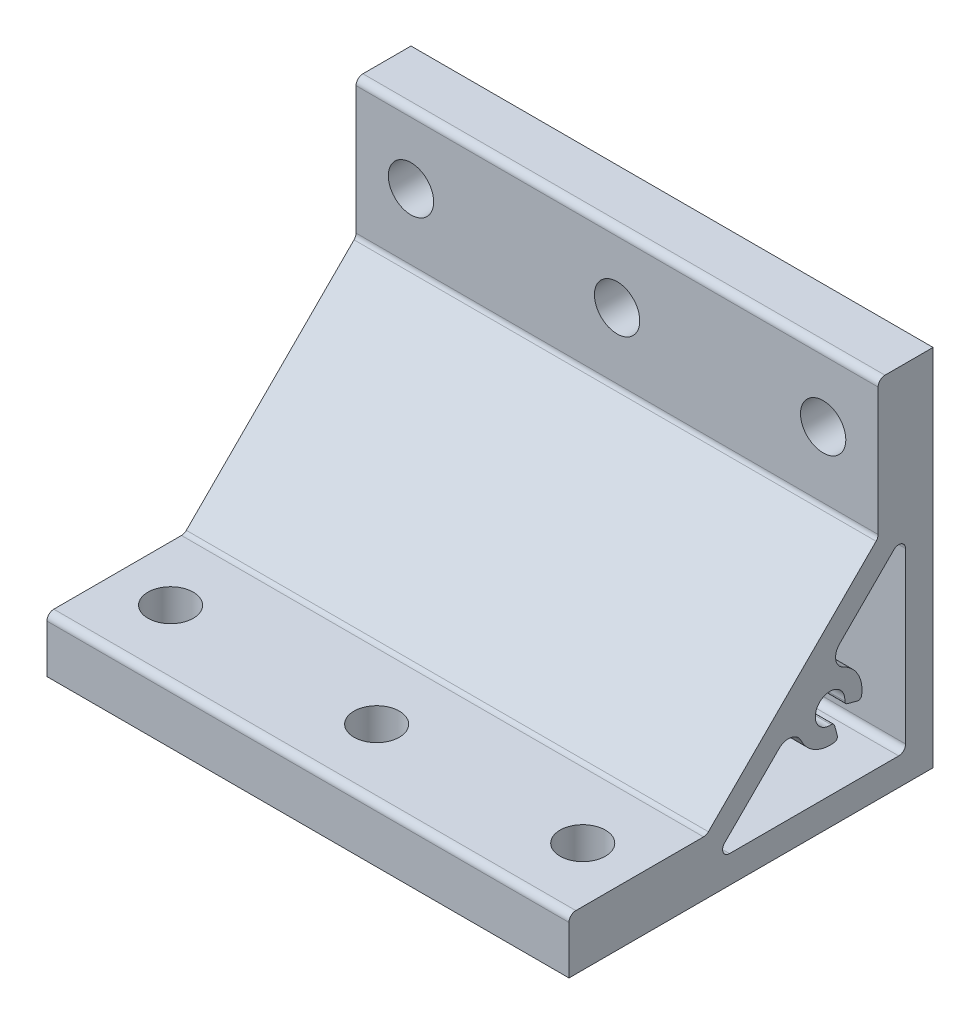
ISO-10303-21;
HEADER;
FILE_DESCRIPTION(('STEP AP214'),'2;1');
FILE_NAME('part.step','',(''),(''),'','','');
FILE_SCHEMA(('AUTOMOTIVE_DESIGN { 1 0 10303 214 1 1 1 1 }'));
ENDSEC;
DATA;
#1=APPLICATION_CONTEXT('core data for automotive mechanical design processes');
#2=APPLICATION_PROTOCOL_DEFINITION('international standard','automotive_design',2000,#1);
#3=PRODUCT_CONTEXT('',#1,'mechanical');
#4=PRODUCT('Part','Part','',(#3));
#5=PRODUCT_RELATED_PRODUCT_CATEGORY('part','',(#4));
#6=PRODUCT_DEFINITION_FORMATION('','',#4);
#7=PRODUCT_DEFINITION_CONTEXT('part definition',#1,'design');
#8=PRODUCT_DEFINITION('design','',#6,#7);
#9=PRODUCT_DEFINITION_SHAPE('','',#8);
#10=(LENGTH_UNIT() NAMED_UNIT(*) SI_UNIT(.MILLI.,.METRE.));
#11=(NAMED_UNIT(*) PLANE_ANGLE_UNIT() SI_UNIT($,.RADIAN.));
#12=(NAMED_UNIT(*) SI_UNIT($,.STERADIAN.) SOLID_ANGLE_UNIT());
#13=UNCERTAINTY_MEASURE_WITH_UNIT(LENGTH_MEASURE(1.E-05),#10,'distance_accuracy_value','');
#14=(GEOMETRIC_REPRESENTATION_CONTEXT(3) GLOBAL_UNCERTAINTY_ASSIGNED_CONTEXT((#13)) GLOBAL_UNIT_ASSIGNED_CONTEXT((#10,
#11,#12)) REPRESENTATION_CONTEXT('',''));
#15=CARTESIAN_POINT('',(0.,0.,0.));
#16=DIRECTION('',(0.,0.,1.));
#17=DIRECTION('',(1.,0.,0.));
#18=AXIS2_PLACEMENT_3D('',#15,#16,#17);
#19=CARTESIAN_POINT('',(38.,51.9999999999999,7.00000000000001));
#20=DIRECTION('',(1.,0.,0.));
#21=DIRECTION('',(0.,0.,-1.));
#22=AXIS2_PLACEMENT_3D('',#19,#20,#21);
#23=PLANE('',#22);
#24=DIRECTION('',(0.,0.,-1.));
#25=VECTOR('',#24,1.);
#26=CARTESIAN_POINT('',(38.,0.,53.));
#27=LINE('',#26,#25);
#28=CARTESIAN_POINT('',(38.,0.,53.));
#29=VERTEX_POINT('',#28);
#30=CARTESIAN_POINT('',(38.,0.,0.));
#31=VERTEX_POINT('',#30);
#32=EDGE_CURVE('E362',#29,#31,#27,.T.);
#33=ORIENTED_EDGE('',*,*,#32,.T.);
#34=DIRECTION('',(0.,1.,0.));
#35=VECTOR('',#34,1.);
#36=CARTESIAN_POINT('',(38.,0.,0.));
#37=LINE('',#36,#35);
#38=CARTESIAN_POINT('',(38.,53.,0.));
#39=VERTEX_POINT('',#38);
#40=EDGE_CURVE('E365',#31,#39,#37,.T.);
#41=ORIENTED_EDGE('',*,*,#40,.T.);
#42=DIRECTION('',(0.,0.,1.));
#43=VECTOR('',#42,1.);
#44=CARTESIAN_POINT('',(38.,52.9999999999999,7.00000000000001));
#45=LINE('',#44,#43);
#46=CARTESIAN_POINT('',(38.,52.9999999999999,7.00000000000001));
#47=VERTEX_POINT('',#46);
#48=EDGE_CURVE('E368',#39,#47,#45,.T.);
#49=ORIENTED_EDGE('',*,*,#48,.T.);
#50=CARTESIAN_POINT('',(38.,51.9999999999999,7.00000000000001));
#51=DIRECTION('',(1.,0.,0.));
#52=DIRECTION('',(0.,0.,-1.));
#53=AXIS2_PLACEMENT_3D('',#50,#51,#52);
#54=CIRCLE('',#53,1.);
#55=CARTESIAN_POINT('',(38.,51.9999999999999,8.00000000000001));
#56=VERTEX_POINT('',#55);
#57=EDGE_CURVE('E370',#47,#56,#54,.T.);
#58=ORIENTED_EDGE('',*,*,#57,.T.);
#59=DIRECTION('',(0.,-1.,0.));
#60=VECTOR('',#59,1.);
#61=CARTESIAN_POINT('',(38.,33.4142135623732,8.00000000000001));
#62=LINE('',#61,#60);
#63=CARTESIAN_POINT('',(38.,33.4142135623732,8.00000000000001));
#64=VERTEX_POINT('',#63);
#65=EDGE_CURVE('E372',#56,#64,#62,.T.);
#66=ORIENTED_EDGE('',*,*,#65,.T.);
#67=CARTESIAN_POINT('',(38.,33.4142135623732,9.00000000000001));
#68=DIRECTION('',(-1.,0.,0.));
#69=DIRECTION('',(0.,0.,-1.));
#70=AXIS2_PLACEMENT_3D('',#67,#68,#69);
#71=CIRCLE('',#70,1.00000000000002);
#72=CARTESIAN_POINT('',(38.,32.7071067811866,8.29289321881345));
#73=VERTEX_POINT('',#72);
#74=EDGE_CURVE('E374',#64,#73,#71,.T.);
#75=ORIENTED_EDGE('',*,*,#74,.T.);
#76=DIRECTION('',(0.,-0.707106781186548,0.707106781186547));
#77=VECTOR('',#76,1.);
#78=CARTESIAN_POINT('',(38.,32.7071067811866,8.29289321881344));
#79=LINE('',#78,#77);
#80=CARTESIAN_POINT('',(38.,8.29289321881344,32.7071067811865));
#81=VERTEX_POINT('',#80);
#82=EDGE_CURVE('E376',#73,#81,#79,.T.);
#83=ORIENTED_EDGE('',*,*,#82,.T.);
#84=CARTESIAN_POINT('',(38.,9.00000000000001,33.4142135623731));
#85=DIRECTION('',(-1.,0.,0.));
#86=DIRECTION('',(0.,0.,-1.));
#87=AXIS2_PLACEMENT_3D('',#84,#85,#86);
#88=CIRCLE('',#87,1.00000000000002);
#89=CARTESIAN_POINT('',(38.,7.99999999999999,33.4142135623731));
#90=VERTEX_POINT('',#89);
#91=EDGE_CURVE('E378',#81,#90,#88,.T.);
#92=ORIENTED_EDGE('',*,*,#91,.T.);
#93=DIRECTION('',(0.,0.,1.));
#94=VECTOR('',#93,1.);
#95=CARTESIAN_POINT('',(38.,8.00000000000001,52.));
#96=LINE('',#95,#94);
#97=CARTESIAN_POINT('',(38.,8.00000000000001,52.));
#98=VERTEX_POINT('',#97);
#99=EDGE_CURVE('E380',#90,#98,#96,.T.);
#100=ORIENTED_EDGE('',*,*,#99,.T.);
#101=CARTESIAN_POINT('',(38.,7.00000000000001,52.));
#102=DIRECTION('',(1.,0.,0.));
#103=DIRECTION('',(0.,0.,-1.));
#104=AXIS2_PLACEMENT_3D('',#101,#102,#103);
#105=CIRCLE('',#104,1.);
#106=CARTESIAN_POINT('',(38.,7.00000000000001,53.));
#107=VERTEX_POINT('',#106);
#108=EDGE_CURVE('E382',#98,#107,#105,.T.);
#109=ORIENTED_EDGE('',*,*,#108,.T.);
#110=DIRECTION('',(0.,-1.,0.));
#111=VECTOR('',#110,1.);
#112=CARTESIAN_POINT('',(38.,0.,53.));
#113=LINE('',#112,#111);
#114=EDGE_CURVE('E384',#107,#29,#113,.T.);
#115=ORIENTED_EDGE('',*,*,#114,.T.);
#116=EDGE_LOOP('',(#33,#41,#49,#58,#66,#75,#83,#92,#100,#109,#115));
#117=FACE_BOUND('',#116,.T.);
#118=DIRECTION('',(0.,-0.707106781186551,0.707106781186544));
#119=VECTOR('',#118,1.);
#120=CARTESIAN_POINT('',(38.,13.6074107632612,22.442841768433));
#121=LINE('',#120,#119);
#122=CARTESIAN_POINT('',(38.,13.6074107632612,22.442841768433));
#123=VERTEX_POINT('',#122);
#124=CARTESIAN_POINT('',(38.,5.70710678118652,30.3431457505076));
#125=VERTEX_POINT('',#124);
#126=EDGE_CURVE('E233',#123,#125,#121,.T.);
#127=ORIENTED_EDGE('',*,*,#126,.F.);
#128=CARTESIAN_POINT('',(38.,12.193197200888,21.0286282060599));
#129=DIRECTION('',(1.,0.,0.));
#130=DIRECTION('',(0.,0.,-1.));
#131=AXIS2_PLACEMENT_3D('',#128,#129,#130);
#132=CIRCLE('',#131,2.00000000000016);
#133=CARTESIAN_POINT('',(38.,13.0373484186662,19.2155069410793));
#134=VERTEX_POINT('',#133);
#135=EDGE_CURVE('E225',#134,#123,#132,.T.);
#136=ORIENTED_EDGE('',*,*,#135,.F.);
#137=CARTESIAN_POINT('',(38.,15.,15.));
#138=DIRECTION('',(-1.,0.,0.));
#139=DIRECTION('',(0.,0.,-1.));
#140=AXIS2_PLACEMENT_3D('',#137,#138,#139);
#141=CIRCLE('',#140,4.65);
#142=CARTESIAN_POINT('',(38.,10.3961625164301,14.3464095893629));
#143=VERTEX_POINT('',#142);
#144=EDGE_CURVE('E279',#143,#134,#141,.T.);
#145=ORIENTED_EDGE('',*,*,#144,.F.);
#146=CARTESIAN_POINT('',(38.,10.891198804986,14.4166881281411));
#147=DIRECTION('',(-1.,0.,0.));
#148=DIRECTION('',(0.,0.,-1.));
#149=AXIS2_PLACEMENT_3D('',#146,#147,#148);
#150=CIRCLE('',#149,0.499999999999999);
#151=CARTESIAN_POINT('',(38.,11.0206083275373,13.9337252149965));
#152=VERTEX_POINT('',#151);
#153=EDGE_CURVE('E277',#152,#143,#150,.T.);
#154=ORIENTED_EDGE('',*,*,#153,.F.);
#155=DIRECTION('',(0.,-0.965925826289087,-0.258819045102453));
#156=VECTOR('',#155,1.);
#157=CARTESIAN_POINT('',(38.,11.0206083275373,13.9337252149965));
#158=LINE('',#157,#156);
#159=CARTESIAN_POINT('',(38.,12.4862719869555,14.3264486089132));
#160=VERTEX_POINT('',#159);
#161=EDGE_CURVE('E275',#160,#152,#158,.T.);
#162=ORIENTED_EDGE('',*,*,#161,.F.);
#163=CARTESIAN_POINT('',(38.,12.3568624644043,14.8094115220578));
#164=DIRECTION('',(-1.,0.,0.));
#165=DIRECTION('',(0.,0.,-1.));
#166=AXIS2_PLACEMENT_3D('',#163,#164,#165);
#167=CIRCLE('',#166,0.49999999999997);
#168=CARTESIAN_POINT('',(38.,12.8555676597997,14.8453716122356));
#169=VERTEX_POINT('',#168);
#170=EDGE_CURVE('E273',#169,#160,#167,.T.);
#171=ORIENTED_EDGE('',*,*,#170,.F.);
#172=CARTESIAN_POINT('',(38.,15.,15.));
#173=DIRECTION('',(1.,0.,0.));
#174=DIRECTION('',(0.,0.,-1.));
#175=AXIS2_PLACEMENT_3D('',#172,#173,#174);
#176=CIRCLE('',#175,2.14999999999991);
#177=CARTESIAN_POINT('',(38.,14.8453716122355,12.8555676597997));
#178=VERTEX_POINT('',#177);
#179=EDGE_CURVE('E271',#178,#169,#176,.T.);
#180=ORIENTED_EDGE('',*,*,#179,.F.);
#181=CARTESIAN_POINT('',(38.,14.8094115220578,12.3568624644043));
#182=DIRECTION('',(-1.,0.,0.));
#183=DIRECTION('',(0.,0.,-1.));
#184=AXIS2_PLACEMENT_3D('',#181,#182,#183);
#185=CIRCLE('',#184,0.499999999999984);
#186=CARTESIAN_POINT('',(38.,14.3264486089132,12.4862719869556));
#187=VERTEX_POINT('',#186);
#188=EDGE_CURVE('E269',#187,#178,#185,.T.);
#189=ORIENTED_EDGE('',*,*,#188,.F.);
#190=DIRECTION('',(0.,0.2588190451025,0.965925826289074));
#191=VECTOR('',#190,1.);
#192=CARTESIAN_POINT('',(38.,13.9337252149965,11.0206083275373));
#193=LINE('',#192,#191);
#194=CARTESIAN_POINT('',(38.,13.9337252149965,11.0206083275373));
#195=VERTEX_POINT('',#194);
#196=EDGE_CURVE('E267',#195,#187,#193,.T.);
#197=ORIENTED_EDGE('',*,*,#196,.F.);
#198=CARTESIAN_POINT('',(38.,14.416688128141,10.8911988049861));
#199=DIRECTION('',(-1.,0.,0.));
#200=DIRECTION('',(0.,0.,-1.));
#201=AXIS2_PLACEMENT_3D('',#198,#199,#200);
#202=CIRCLE('',#201,0.499999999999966);
#203=CARTESIAN_POINT('',(38.,14.3464095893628,10.3961625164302));
#204=VERTEX_POINT('',#203);
#205=EDGE_CURVE('E265',#204,#195,#202,.T.);
#206=ORIENTED_EDGE('',*,*,#205,.F.);
#207=CARTESIAN_POINT('',(38.,15.,15.));
#208=DIRECTION('',(-1.,0.,0.));
#209=DIRECTION('',(0.,0.,-1.));
#210=AXIS2_PLACEMENT_3D('',#207,#208,#209);
#211=CIRCLE('',#210,4.64999999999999);
#212=CARTESIAN_POINT('',(38.,19.2155069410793,13.0373484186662));
#213=VERTEX_POINT('',#212);
#214=EDGE_CURVE('E263',#213,#204,#211,.T.);
#215=ORIENTED_EDGE('',*,*,#214,.F.);
#216=CARTESIAN_POINT('',(38.,21.0286282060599,12.1931972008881));
#217=DIRECTION('',(1.,0.,0.));
#218=DIRECTION('',(0.,0.,-1.));
#219=AXIS2_PLACEMENT_3D('',#216,#217,#218);
#220=CIRCLE('',#219,2.00000000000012);
#221=CARTESIAN_POINT('',(38.,22.4428417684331,13.6074107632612));
#222=VERTEX_POINT('',#221);
#223=EDGE_CURVE('E261',#222,#213,#220,.T.);
#224=ORIENTED_EDGE('',*,*,#223,.F.);
#225=DIRECTION('',(0.,-0.70710678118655,0.707106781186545));
#226=VECTOR('',#225,1.);
#227=CARTESIAN_POINT('',(38.,30.3431457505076,5.70710678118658));
#228=LINE('',#227,#226);
#229=CARTESIAN_POINT('',(38.,30.3431457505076,5.70710678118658));
#230=VERTEX_POINT('',#229);
#231=EDGE_CURVE('E259',#230,#222,#228,.T.);
#232=ORIENTED_EDGE('',*,*,#231,.F.);
#233=CARTESIAN_POINT('',(38.,29.6360389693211,5.));
#234=DIRECTION('',(1.,0.,0.));
#235=DIRECTION('',(0.,0.,-1.));
#236=AXIS2_PLACEMENT_3D('',#233,#234,#235);
#237=CIRCLE('',#236,0.999999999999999);
#238=CARTESIAN_POINT('',(38.,29.6360389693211,4.00000000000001));
#239=VERTEX_POINT('',#238);
#240=EDGE_CURVE('E257',#239,#230,#237,.T.);
#241=ORIENTED_EDGE('',*,*,#240,.F.);
#242=DIRECTION('',(0.,1.,0.));
#243=VECTOR('',#242,1.);
#244=CARTESIAN_POINT('',(38.,5.,4.));
#245=LINE('',#244,#243);
#246=CARTESIAN_POINT('',(38.,5.,4.));
#247=VERTEX_POINT('',#246);
#248=EDGE_CURVE('E255',#247,#239,#245,.T.);
#249=ORIENTED_EDGE('',*,*,#248,.F.);
#250=CARTESIAN_POINT('',(38.,5.,5.));
#251=DIRECTION('',(1.,0.,0.));
#252=DIRECTION('',(0.,0.,-1.));
#253=AXIS2_PLACEMENT_3D('',#250,#251,#252);
#254=CIRCLE('',#253,1.);
#255=CARTESIAN_POINT('',(38.,4.,5.));
#256=VERTEX_POINT('',#255);
#257=EDGE_CURVE('E253',#256,#247,#254,.T.);
#258=ORIENTED_EDGE('',*,*,#257,.F.);
#259=DIRECTION('',(0.,0.,-1.));
#260=VECTOR('',#259,1.);
#261=CARTESIAN_POINT('',(38.,4.,29.6360389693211));
#262=LINE('',#261,#260);
#263=CARTESIAN_POINT('',(38.,4.,29.6360389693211));
#264=VERTEX_POINT('',#263);
#265=EDGE_CURVE('E248',#264,#256,#262,.T.);
#266=ORIENTED_EDGE('',*,*,#265,.F.);
#267=CARTESIAN_POINT('',(38.,5.,29.6360389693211));
#268=DIRECTION('',(1.,0.,0.));
#269=DIRECTION('',(0.,0.,-1.));
#270=AXIS2_PLACEMENT_3D('',#267,#268,#269);
#271=CIRCLE('',#270,0.999999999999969);
#272=EDGE_CURVE('E246',#125,#264,#271,.T.);
#273=ORIENTED_EDGE('',*,*,#272,.F.);
#274=EDGE_LOOP('',(#127,#136,#145,#154,#162,#171,#180,#189,#197,#206,#215,#224,#232,#241,#249,
#258,#266,#273));
#275=FACE_BOUND('',#274,.T.);
#276=ADVANCED_FACE('F34',(#117,#275),#23,.T.);
#277=CARTESIAN_POINT('',(-38.,51.9999999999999,7.00000000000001));
#278=DIRECTION('',(1.,0.,0.));
#279=DIRECTION('',(0.,0.,-1.));
#280=AXIS2_PLACEMENT_3D('',#277,#278,#279);
#281=PLANE('',#280);
#282=DIRECTION('',(0.,0.,-1.));
#283=VECTOR('',#282,1.);
#284=CARTESIAN_POINT('',(-38.,0.,53.));
#285=LINE('',#284,#283);
#286=CARTESIAN_POINT('',(-38.,0.,53.));
#287=VERTEX_POINT('',#286);
#288=CARTESIAN_POINT('',(-38.,0.,0.));
#289=VERTEX_POINT('',#288);
#290=EDGE_CURVE('E241',#287,#289,#285,.T.);
#291=ORIENTED_EDGE('',*,*,#290,.F.);
#292=DIRECTION('',(0.,-1.,0.));
#293=VECTOR('',#292,1.);
#294=CARTESIAN_POINT('',(-38.,0.,53.));
#295=LINE('',#294,#293);
#296=CARTESIAN_POINT('',(-38.,7.00000000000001,53.));
#297=VERTEX_POINT('',#296);
#298=EDGE_CURVE('E366',#297,#287,#295,.T.);
#299=ORIENTED_EDGE('',*,*,#298,.F.);
#300=CARTESIAN_POINT('',(-38.,7.00000000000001,52.));
#301=DIRECTION('',(1.,0.,0.));
#302=DIRECTION('',(0.,0.,-1.));
#303=AXIS2_PLACEMENT_3D('',#300,#301,#302);
#304=CIRCLE('',#303,1.);
#305=CARTESIAN_POINT('',(-38.,8.00000000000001,52.));
#306=VERTEX_POINT('',#305);
#307=EDGE_CURVE('E405',#306,#297,#304,.T.);
#308=ORIENTED_EDGE('',*,*,#307,.F.);
#309=DIRECTION('',(0.,0.,1.));
#310=VECTOR('',#309,1.);
#311=CARTESIAN_POINT('',(-38.,8.00000000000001,52.));
#312=LINE('',#311,#310);
#313=CARTESIAN_POINT('',(-38.,7.99999999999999,33.4142135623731));
#314=VERTEX_POINT('',#313);
#315=EDGE_CURVE('E403',#314,#306,#312,.T.);
#316=ORIENTED_EDGE('',*,*,#315,.F.);
#317=CARTESIAN_POINT('',(-38.,9.00000000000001,33.4142135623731));
#318=DIRECTION('',(-1.,0.,0.));
#319=DIRECTION('',(0.,0.,-1.));
#320=AXIS2_PLACEMENT_3D('',#317,#318,#319);
#321=CIRCLE('',#320,1.00000000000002);
#322=CARTESIAN_POINT('',(-38.,8.29289321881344,32.7071067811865));
#323=VERTEX_POINT('',#322);
#324=EDGE_CURVE('E401',#323,#314,#321,.T.);
#325=ORIENTED_EDGE('',*,*,#324,.F.);
#326=DIRECTION('',(0.,-0.707106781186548,0.707106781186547));
#327=VECTOR('',#326,1.);
#328=CARTESIAN_POINT('',(-38.,32.7071067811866,8.29289321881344));
#329=LINE('',#328,#327);
#330=CARTESIAN_POINT('',(-38.,32.7071067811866,8.29289321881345));
#331=VERTEX_POINT('',#330);
#332=EDGE_CURVE('E399',#331,#323,#329,.T.);
#333=ORIENTED_EDGE('',*,*,#332,.F.);
#334=CARTESIAN_POINT('',(-38.,33.4142135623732,9.00000000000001));
#335=DIRECTION('',(-1.,0.,0.));
#336=DIRECTION('',(0.,0.,-1.));
#337=AXIS2_PLACEMENT_3D('',#334,#335,#336);
#338=CIRCLE('',#337,1.00000000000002);
#339=CARTESIAN_POINT('',(-38.,33.4142135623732,8.00000000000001));
#340=VERTEX_POINT('',#339);
#341=EDGE_CURVE('E397',#340,#331,#338,.T.);
#342=ORIENTED_EDGE('',*,*,#341,.F.);
#343=DIRECTION('',(0.,-1.,0.));
#344=VECTOR('',#343,1.);
#345=CARTESIAN_POINT('',(-38.,33.4142135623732,8.00000000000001));
#346=LINE('',#345,#344);
#347=CARTESIAN_POINT('',(-38.,51.9999999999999,8.00000000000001));
#348=VERTEX_POINT('',#347);
#349=EDGE_CURVE('E395',#348,#340,#346,.T.);
#350=ORIENTED_EDGE('',*,*,#349,.F.);
#351=CARTESIAN_POINT('',(-38.,51.9999999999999,7.00000000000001));
#352=DIRECTION('',(1.,0.,0.));
#353=DIRECTION('',(0.,0.,-1.));
#354=AXIS2_PLACEMENT_3D('',#351,#352,#353);
#355=CIRCLE('',#354,1.);
#356=CARTESIAN_POINT('',(-38.,52.9999999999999,7.00000000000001));
#357=VERTEX_POINT('',#356);
#358=EDGE_CURVE('E393',#357,#348,#355,.T.);
#359=ORIENTED_EDGE('',*,*,#358,.F.);
#360=DIRECTION('',(0.,0.,1.));
#361=VECTOR('',#360,1.);
#362=CARTESIAN_POINT('',(-38.,52.9999999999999,7.00000000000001));
#363=LINE('',#362,#361);
#364=CARTESIAN_POINT('',(-38.,53.,0.));
#365=VERTEX_POINT('',#364);
#366=EDGE_CURVE('E391',#365,#357,#363,.T.);
#367=ORIENTED_EDGE('',*,*,#366,.F.);
#368=DIRECTION('',(0.,1.,0.));
#369=VECTOR('',#368,1.);
#370=CARTESIAN_POINT('',(-38.,0.,0.));
#371=LINE('',#370,#369);
#372=EDGE_CURVE('E389',#289,#365,#371,.T.);
#373=ORIENTED_EDGE('',*,*,#372,.F.);
#374=EDGE_LOOP('',(#291,#299,#308,#316,#325,#333,#342,#350,#359,#367,#373));
#375=FACE_BOUND('',#374,.T.);
#376=CARTESIAN_POINT('',(-38.,12.193197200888,21.0286282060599));
#377=DIRECTION('',(1.,0.,0.));
#378=DIRECTION('',(0.,0.,-1.));
#379=AXIS2_PLACEMENT_3D('',#376,#377,#378);
#380=CIRCLE('',#379,2.00000000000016);
#381=CARTESIAN_POINT('',(-38.,13.0373484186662,19.2155069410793));
#382=VERTEX_POINT('',#381);
#383=CARTESIAN_POINT('',(-38.,13.6074107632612,22.442841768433));
#384=VERTEX_POINT('',#383);
#385=EDGE_CURVE('E57',#382,#384,#380,.T.);
#386=ORIENTED_EDGE('',*,*,#385,.T.);
#387=DIRECTION('',(0.,-0.707106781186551,0.707106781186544));
#388=VECTOR('',#387,1.);
#389=CARTESIAN_POINT('',(-38.,13.6074107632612,22.442841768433));
#390=LINE('',#389,#388);
#391=CARTESIAN_POINT('',(-38.,5.70710678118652,30.3431457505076));
#392=VERTEX_POINT('',#391);
#393=EDGE_CURVE('E240',#384,#392,#390,.T.);
#394=ORIENTED_EDGE('',*,*,#393,.T.);
#395=CARTESIAN_POINT('',(-38.,5.,29.6360389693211));
#396=DIRECTION('',(1.,0.,0.));
#397=DIRECTION('',(0.,0.,-1.));
#398=AXIS2_PLACEMENT_3D('',#395,#396,#397);
#399=CIRCLE('',#398,0.999999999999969);
#400=CARTESIAN_POINT('',(-38.,4.,29.6360389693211));
#401=VERTEX_POINT('',#400);
#402=EDGE_CURVE('E284',#392,#401,#399,.T.);
#403=ORIENTED_EDGE('',*,*,#402,.T.);
#404=DIRECTION('',(0.,0.,-1.));
#405=VECTOR('',#404,1.);
#406=CARTESIAN_POINT('',(-38.,4.,29.6360389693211));
#407=LINE('',#406,#405);
#408=CARTESIAN_POINT('',(-38.,4.,5.));
#409=VERTEX_POINT('',#408);
#410=EDGE_CURVE('E287',#401,#409,#407,.T.);
#411=ORIENTED_EDGE('',*,*,#410,.T.);
#412=CARTESIAN_POINT('',(-38.,5.,5.));
#413=DIRECTION('',(1.,0.,0.));
#414=DIRECTION('',(0.,0.,-1.));
#415=AXIS2_PLACEMENT_3D('',#412,#413,#414);
#416=CIRCLE('',#415,1.);
#417=CARTESIAN_POINT('',(-38.,5.,4.));
#418=VERTEX_POINT('',#417);
#419=EDGE_CURVE('E290',#409,#418,#416,.T.);
#420=ORIENTED_EDGE('',*,*,#419,.T.);
#421=DIRECTION('',(0.,1.,0.));
#422=VECTOR('',#421,1.);
#423=CARTESIAN_POINT('',(-38.,5.,4.));
#424=LINE('',#423,#422);
#425=CARTESIAN_POINT('',(-38.,29.6360389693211,4.00000000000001));
#426=VERTEX_POINT('',#425);
#427=EDGE_CURVE('E293',#418,#426,#424,.T.);
#428=ORIENTED_EDGE('',*,*,#427,.T.);
#429=CARTESIAN_POINT('',(-38.,29.6360389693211,5.));
#430=DIRECTION('',(1.,0.,0.));
#431=DIRECTION('',(0.,0.,-1.));
#432=AXIS2_PLACEMENT_3D('',#429,#430,#431);
#433=CIRCLE('',#432,0.999999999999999);
#434=CARTESIAN_POINT('',(-38.,30.3431457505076,5.70710678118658));
#435=VERTEX_POINT('',#434);
#436=EDGE_CURVE('E296',#426,#435,#433,.T.);
#437=ORIENTED_EDGE('',*,*,#436,.T.);
#438=DIRECTION('',(0.,-0.70710678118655,0.707106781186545));
#439=VECTOR('',#438,1.);
#440=CARTESIAN_POINT('',(-38.,30.3431457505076,5.70710678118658));
#441=LINE('',#440,#439);
#442=CARTESIAN_POINT('',(-38.,22.4428417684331,13.6074107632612));
#443=VERTEX_POINT('',#442);
#444=EDGE_CURVE('E299',#435,#443,#441,.T.);
#445=ORIENTED_EDGE('',*,*,#444,.T.);
#446=CARTESIAN_POINT('',(-38.,21.0286282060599,12.1931972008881));
#447=DIRECTION('',(1.,0.,0.));
#448=DIRECTION('',(0.,0.,-1.));
#449=AXIS2_PLACEMENT_3D('',#446,#447,#448);
#450=CIRCLE('',#449,2.00000000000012);
#451=CARTESIAN_POINT('',(-38.,19.2155069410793,13.0373484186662));
#452=VERTEX_POINT('',#451);
#453=EDGE_CURVE('E302',#443,#452,#450,.T.);
#454=ORIENTED_EDGE('',*,*,#453,.T.);
#455=CARTESIAN_POINT('',(-38.,15.,15.));
#456=DIRECTION('',(-1.,0.,0.));
#457=DIRECTION('',(0.,0.,-1.));
#458=AXIS2_PLACEMENT_3D('',#455,#456,#457);
#459=CIRCLE('',#458,4.64999999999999);
#460=CARTESIAN_POINT('',(-38.,14.3464095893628,10.3961625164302));
#461=VERTEX_POINT('',#460);
#462=EDGE_CURVE('E305',#452,#461,#459,.T.);
#463=ORIENTED_EDGE('',*,*,#462,.T.);
#464=CARTESIAN_POINT('',(-38.,14.416688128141,10.8911988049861));
#465=DIRECTION('',(-1.,0.,0.));
#466=DIRECTION('',(0.,0.,-1.));
#467=AXIS2_PLACEMENT_3D('',#464,#465,#466);
#468=CIRCLE('',#467,0.499999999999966);
#469=CARTESIAN_POINT('',(-38.,13.9337252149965,11.0206083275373));
#470=VERTEX_POINT('',#469);
#471=EDGE_CURVE('E308',#461,#470,#468,.T.);
#472=ORIENTED_EDGE('',*,*,#471,.T.);
#473=DIRECTION('',(0.,0.2588190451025,0.965925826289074));
#474=VECTOR('',#473,1.);
#475=CARTESIAN_POINT('',(-38.,13.9337252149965,11.0206083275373));
#476=LINE('',#475,#474);
#477=CARTESIAN_POINT('',(-38.,14.3264486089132,12.4862719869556));
#478=VERTEX_POINT('',#477);
#479=EDGE_CURVE('E311',#470,#478,#476,.T.);
#480=ORIENTED_EDGE('',*,*,#479,.T.);
#481=CARTESIAN_POINT('',(-38.,14.8094115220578,12.3568624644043));
#482=DIRECTION('',(-1.,0.,0.));
#483=DIRECTION('',(0.,0.,-1.));
#484=AXIS2_PLACEMENT_3D('',#481,#482,#483);
#485=CIRCLE('',#484,0.499999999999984);
#486=CARTESIAN_POINT('',(-38.,14.8453716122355,12.8555676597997));
#487=VERTEX_POINT('',#486);
#488=EDGE_CURVE('E314',#478,#487,#485,.T.);
#489=ORIENTED_EDGE('',*,*,#488,.T.);
#490=CARTESIAN_POINT('',(-38.,15.,15.));
#491=DIRECTION('',(1.,0.,0.));
#492=DIRECTION('',(0.,0.,-1.));
#493=AXIS2_PLACEMENT_3D('',#490,#491,#492);
#494=CIRCLE('',#493,2.14999999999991);
#495=CARTESIAN_POINT('',(-38.,12.8555676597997,14.8453716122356));
#496=VERTEX_POINT('',#495);
#497=EDGE_CURVE('E317',#487,#496,#494,.T.);
#498=ORIENTED_EDGE('',*,*,#497,.T.);
#499=CARTESIAN_POINT('',(-38.,12.3568624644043,14.8094115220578));
#500=DIRECTION('',(-1.,0.,0.));
#501=DIRECTION('',(0.,0.,-1.));
#502=AXIS2_PLACEMENT_3D('',#499,#500,#501);
#503=CIRCLE('',#502,0.49999999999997);
#504=CARTESIAN_POINT('',(-38.,12.4862719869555,14.3264486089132));
#505=VERTEX_POINT('',#504);
#506=EDGE_CURVE('E320',#496,#505,#503,.T.);
#507=ORIENTED_EDGE('',*,*,#506,.T.);
#508=DIRECTION('',(0.,-0.965925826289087,-0.258819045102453));
#509=VECTOR('',#508,1.);
#510=CARTESIAN_POINT('',(-38.,11.0206083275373,13.9337252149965));
#511=LINE('',#510,#509);
#512=CARTESIAN_POINT('',(-38.,11.0206083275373,13.9337252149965));
#513=VERTEX_POINT('',#512);
#514=EDGE_CURVE('E323',#505,#513,#511,.T.);
#515=ORIENTED_EDGE('',*,*,#514,.T.);
#516=CARTESIAN_POINT('',(-38.,10.891198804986,14.4166881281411));
#517=DIRECTION('',(-1.,0.,0.));
#518=DIRECTION('',(0.,0.,-1.));
#519=AXIS2_PLACEMENT_3D('',#516,#517,#518);
#520=CIRCLE('',#519,0.499999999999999);
#521=CARTESIAN_POINT('',(-38.,10.3961625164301,14.3464095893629));
#522=VERTEX_POINT('',#521);
#523=EDGE_CURVE('E326',#513,#522,#520,.T.);
#524=ORIENTED_EDGE('',*,*,#523,.T.);
#525=CARTESIAN_POINT('',(-38.,15.,15.));
#526=DIRECTION('',(-1.,0.,0.));
#527=DIRECTION('',(0.,0.,-1.));
#528=AXIS2_PLACEMENT_3D('',#525,#526,#527);
#529=CIRCLE('',#528,4.65);
#530=EDGE_CURVE('E234',#522,#382,#529,.T.);
#531=ORIENTED_EDGE('',*,*,#530,.T.);
#532=EDGE_LOOP('',(#386,#394,#403,#411,#420,#428,#437,#445,#454,#463,#472,#480,#489,#498,#507,
#515,#524,#531));
#533=FACE_BOUND('',#532,.T.);
#534=ADVANCED_FACE('F444',(#375,#533),#281,.F.);
#535=CARTESIAN_POINT('',(38.,0.,53.));
#536=DIRECTION('',(0.,1.,0.));
#537=DIRECTION('',(0.,0.,1.));
#538=AXIS2_PLACEMENT_3D('',#535,#536,#537);
#539=PLANE('',#538);
#540=CARTESIAN_POINT('',(-30.,0.,43.));
#541=DIRECTION('',(0.,1.,0.));
#542=DIRECTION('',(0.,0.,1.));
#543=AXIS2_PLACEMENT_3D('',#540,#541,#542);
#544=CIRCLE('',#543,3.3);
#545=CARTESIAN_POINT('',(-30.,0.,46.3));
#546=VERTEX_POINT('',#545);
#547=EDGE_CURVE('E834',#546,#546,#544,.T.);
#548=ORIENTED_EDGE('',*,*,#547,.T.);
#549=EDGE_LOOP('',(#548));
#550=FACE_BOUND('',#549,.T.);
#551=CARTESIAN_POINT('',(0.,0.,43.));
#552=DIRECTION('',(0.,1.,0.));
#553=DIRECTION('',(0.,0.,1.));
#554=AXIS2_PLACEMENT_3D('',#551,#552,#553);
#555=CIRCLE('',#554,3.3);
#556=CARTESIAN_POINT('',(0.,0.,46.3));
#557=VERTEX_POINT('',#556);
#558=EDGE_CURVE('E838',#557,#557,#555,.T.);
#559=ORIENTED_EDGE('',*,*,#558,.T.);
#560=EDGE_LOOP('',(#559));
#561=FACE_BOUND('',#560,.T.);
#562=CARTESIAN_POINT('',(30.,0.,43.));
#563=DIRECTION('',(0.,1.,0.));
#564=DIRECTION('',(0.,0.,1.));
#565=AXIS2_PLACEMENT_3D('',#562,#563,#564);
#566=CIRCLE('',#565,3.3);
#567=CARTESIAN_POINT('',(30.,0.,46.3));
#568=VERTEX_POINT('',#567);
#569=EDGE_CURVE('E841',#568,#568,#566,.T.);
#570=ORIENTED_EDGE('',*,*,#569,.T.);
#571=EDGE_LOOP('',(#570));
#572=FACE_BOUND('',#571,.T.);
#573=ORIENTED_EDGE('',*,*,#290,.T.);
#574=DIRECTION('',(-1.,0.,0.));
#575=VECTOR('',#574,1.);
#576=CARTESIAN_POINT('',(38.,0.,0.));
#577=LINE('',#576,#575);
#578=EDGE_CURVE('E11',#31,#289,#577,.T.);
#579=ORIENTED_EDGE('',*,*,#578,.F.);
#580=ORIENTED_EDGE('',*,*,#32,.F.);
#581=DIRECTION('',(-1.,0.,0.));
#582=VECTOR('',#581,1.);
#583=CARTESIAN_POINT('',(38.,0.,53.));
#584=LINE('',#583,#582);
#585=EDGE_CURVE('E386',#29,#287,#584,.T.);
#586=ORIENTED_EDGE('',*,*,#585,.T.);
#587=EDGE_LOOP('',(#573,#579,#580,#586));
#588=FACE_BOUND('',#587,.T.);
#589=ADVANCED_FACE('F36',(#550,#561,#572,#588),#539,.F.);
#590=CARTESIAN_POINT('',(38.,0.,0.));
#591=DIRECTION('',(0.,0.,1.));
#592=DIRECTION('',(1.,0.,0.));
#593=AXIS2_PLACEMENT_3D('',#590,#591,#592);
#594=PLANE('',#593);
#595=CARTESIAN_POINT('',(-30.,42.9999999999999,0.));
#596=DIRECTION('',(0.,0.,1.));
#597=DIRECTION('',(1.,0.,0.));
#598=AXIS2_PLACEMENT_3D('',#595,#596,#597);
#599=CIRCLE('',#598,3.3);
#600=CARTESIAN_POINT('',(-26.7,42.9999999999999,0.));
#601=VERTEX_POINT('',#600);
#602=EDGE_CURVE('E846',#601,#601,#599,.T.);
#603=ORIENTED_EDGE('',*,*,#602,.T.);
#604=EDGE_LOOP('',(#603));
#605=FACE_BOUND('',#604,.T.);
#606=CARTESIAN_POINT('',(0.,42.9999999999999,0.));
#607=DIRECTION('',(0.,0.,1.));
#608=DIRECTION('',(1.,0.,0.));
#609=AXIS2_PLACEMENT_3D('',#606,#607,#608);
#610=CIRCLE('',#609,3.3);
#611=CARTESIAN_POINT('',(3.3,42.9999999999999,0.));
#612=VERTEX_POINT('',#611);
#613=EDGE_CURVE('E857',#612,#612,#610,.T.);
#614=ORIENTED_EDGE('',*,*,#613,.T.);
#615=EDGE_LOOP('',(#614));
#616=FACE_BOUND('',#615,.T.);
#617=CARTESIAN_POINT('',(30.,42.9999999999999,0.));
#618=DIRECTION('',(0.,0.,1.));
#619=DIRECTION('',(1.,0.,0.));
#620=AXIS2_PLACEMENT_3D('',#617,#618,#619);
#621=CIRCLE('',#620,3.3);
#622=CARTESIAN_POINT('',(33.3,42.9999999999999,0.));
#623=VERTEX_POINT('',#622);
#624=EDGE_CURVE('E282',#623,#623,#621,.T.);
#625=ORIENTED_EDGE('',*,*,#624,.T.);
#626=EDGE_LOOP('',(#625));
#627=FACE_BOUND('',#626,.T.);
#628=ORIENTED_EDGE('',*,*,#372,.T.);
#629=DIRECTION('',(-1.,0.,0.));
#630=VECTOR('',#629,1.);
#631=CARTESIAN_POINT('',(38.,53.,0.));
#632=LINE('',#631,#630);
#633=EDGE_CURVE('E42',#39,#365,#632,.T.);
#634=ORIENTED_EDGE('',*,*,#633,.F.);
#635=ORIENTED_EDGE('',*,*,#40,.F.);
#636=ORIENTED_EDGE('',*,*,#578,.T.);
#637=EDGE_LOOP('',(#628,#634,#635,#636));
#638=FACE_BOUND('',#637,.T.);
#639=ADVANCED_FACE('F461',(#605,#616,#627,#638),#594,.F.);
#640=CARTESIAN_POINT('',(38.,52.9999999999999,7.00000000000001));
#641=DIRECTION('',(0.,-1.,0.));
#642=DIRECTION('',(0.,0.,-1.));
#643=AXIS2_PLACEMENT_3D('',#640,#641,#642);
#644=PLANE('',#643);
#645=ORIENTED_EDGE('',*,*,#366,.T.);
#646=DIRECTION('',(-1.,0.,0.));
#647=VECTOR('',#646,1.);
#648=CARTESIAN_POINT('',(38.,52.9999999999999,7.00000000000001));
#649=LINE('',#648,#647);
#650=EDGE_CURVE('E431',#47,#357,#649,.T.);
#651=ORIENTED_EDGE('',*,*,#650,.F.);
#652=ORIENTED_EDGE('',*,*,#48,.F.);
#653=ORIENTED_EDGE('',*,*,#633,.T.);
#654=EDGE_LOOP('',(#645,#651,#652,#653));
#655=FACE_BOUND('',#654,.T.);
#656=ADVANCED_FACE('F438',(#655),#644,.F.);
#657=CARTESIAN_POINT('',(38.,51.9999999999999,7.00000000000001));
#658=DIRECTION('',(-1.,0.,0.));
#659=DIRECTION('',(0.,0.,1.));
#660=AXIS2_PLACEMENT_3D('',#657,#658,#659);
#661=CYLINDRICAL_SURFACE('',#660,1.);
#662=ORIENTED_EDGE('',*,*,#358,.T.);
#663=DIRECTION('',(-1.,0.,0.));
#664=VECTOR('',#663,1.);
#665=CARTESIAN_POINT('',(38.,51.9999999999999,8.00000000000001));
#666=LINE('',#665,#664);
#667=EDGE_CURVE('E428',#56,#348,#666,.T.);
#668=ORIENTED_EDGE('',*,*,#667,.F.);
#669=ORIENTED_EDGE('',*,*,#57,.F.);
#670=ORIENTED_EDGE('',*,*,#650,.T.);
#671=EDGE_LOOP('',(#662,#668,#669,#670));
#672=FACE_BOUND('',#671,.T.);
#673=ADVANCED_FACE('F450',(#672),#661,.T.);
#674=CARTESIAN_POINT('',(38.,33.4142135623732,8.00000000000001));
#675=DIRECTION('',(0.,0.,-1.));
#676=DIRECTION('',(-1.,0.,0.));
#677=AXIS2_PLACEMENT_3D('',#674,#675,#676);
#678=PLANE('',#677);
#679=CARTESIAN_POINT('',(-30.,42.9999999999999,8.00000000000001));
#680=DIRECTION('',(0.,0.,1.));
#681=DIRECTION('',(1.,0.,0.));
#682=AXIS2_PLACEMENT_3D('',#679,#680,#681);
#683=CIRCLE('',#682,3.29999999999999);
#684=CARTESIAN_POINT('',(-26.7,42.9999999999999,8.00000000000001));
#685=VERTEX_POINT('',#684);
#686=EDGE_CURVE('E842',#685,#685,#683,.T.);
#687=ORIENTED_EDGE('',*,*,#686,.F.);
#688=EDGE_LOOP('',(#687));
#689=FACE_BOUND('',#688,.T.);
#690=CARTESIAN_POINT('',(0.,42.9999999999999,8.00000000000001));
#691=DIRECTION('',(0.,0.,1.));
#692=DIRECTION('',(1.,0.,0.));
#693=AXIS2_PLACEMENT_3D('',#690,#691,#692);
#694=CIRCLE('',#693,3.29999999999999);
#695=CARTESIAN_POINT('',(3.29999999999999,42.9999999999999,8.00000000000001));
#696=VERTEX_POINT('',#695);
#697=EDGE_CURVE('E854',#696,#696,#694,.T.);
#698=ORIENTED_EDGE('',*,*,#697,.F.);
#699=EDGE_LOOP('',(#698));
#700=FACE_BOUND('',#699,.T.);
#701=CARTESIAN_POINT('',(30.,42.9999999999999,8.00000000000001));
#702=DIRECTION('',(0.,0.,1.));
#703=DIRECTION('',(1.,0.,0.));
#704=AXIS2_PLACEMENT_3D('',#701,#702,#703);
#705=CIRCLE('',#704,3.29999999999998);
#706=CARTESIAN_POINT('',(33.3,42.9999999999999,8.00000000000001));
#707=VERTEX_POINT('',#706);
#708=EDGE_CURVE('E860',#707,#707,#705,.T.);
#709=ORIENTED_EDGE('',*,*,#708,.F.);
#710=EDGE_LOOP('',(#709));
#711=FACE_BOUND('',#710,.T.);
#712=ORIENTED_EDGE('',*,*,#349,.T.);
#713=DIRECTION('',(-1.,0.,0.));
#714=VECTOR('',#713,1.);
#715=CARTESIAN_POINT('',(38.,33.4142135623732,8.00000000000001));
#716=LINE('',#715,#714);
#717=EDGE_CURVE('E425',#64,#340,#716,.T.);
#718=ORIENTED_EDGE('',*,*,#717,.F.);
#719=ORIENTED_EDGE('',*,*,#65,.F.);
#720=ORIENTED_EDGE('',*,*,#667,.T.);
#721=EDGE_LOOP('',(#712,#718,#719,#720));
#722=FACE_BOUND('',#721,.T.);
#723=ADVANCED_FACE('F454',(#689,#700,#711,#722),#678,.F.);
#724=CARTESIAN_POINT('',(38.,33.4142135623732,9.00000000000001));
#725=DIRECTION('',(-1.,0.,0.));
#726=DIRECTION('',(0.,0.,1.));
#727=AXIS2_PLACEMENT_3D('',#724,#725,#726);
#728=CYLINDRICAL_SURFACE('',#727,1.00000000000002);
#729=ORIENTED_EDGE('',*,*,#341,.T.);
#730=DIRECTION('',(-1.,0.,0.));
#731=VECTOR('',#730,1.);
#732=CARTESIAN_POINT('',(38.,32.7071067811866,8.29289321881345));
#733=LINE('',#732,#731);
#734=EDGE_CURVE('E422',#73,#331,#733,.T.);
#735=ORIENTED_EDGE('',*,*,#734,.F.);
#736=ORIENTED_EDGE('',*,*,#74,.F.);
#737=ORIENTED_EDGE('',*,*,#717,.T.);
#738=EDGE_LOOP('',(#729,#735,#736,#737));
#739=FACE_BOUND('',#738,.T.);
#740=ADVANCED_FACE('F489',(#739),#728,.F.);
#741=CARTESIAN_POINT('',(38.,32.7071067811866,8.29289321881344));
#742=DIRECTION('',(0.,-0.707106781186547,-0.707106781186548));
#743=DIRECTION('',(0.,0.707106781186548,-0.707106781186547));
#744=AXIS2_PLACEMENT_3D('',#741,#742,#743);
#745=PLANE('',#744);
#746=ORIENTED_EDGE('',*,*,#332,.T.);
#747=DIRECTION('',(-1.,0.,0.));
#748=VECTOR('',#747,1.);
#749=CARTESIAN_POINT('',(38.,8.29289321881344,32.7071067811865));
#750=LINE('',#749,#748);
#751=EDGE_CURVE('E419',#81,#323,#750,.T.);
#752=ORIENTED_EDGE('',*,*,#751,.F.);
#753=ORIENTED_EDGE('',*,*,#82,.F.);
#754=ORIENTED_EDGE('',*,*,#734,.T.);
#755=EDGE_LOOP('',(#746,#752,#753,#754));
#756=FACE_BOUND('',#755,.T.);
#757=ADVANCED_FACE('F487',(#756),#745,.F.);
#758=CARTESIAN_POINT('',(38.,9.00000000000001,33.4142135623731));
#759=DIRECTION('',(-1.,0.,0.));
#760=DIRECTION('',(0.,0.,1.));
#761=AXIS2_PLACEMENT_3D('',#758,#759,#760);
#762=CYLINDRICAL_SURFACE('',#761,1.00000000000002);
#763=ORIENTED_EDGE('',*,*,#324,.T.);
#764=DIRECTION('',(-1.,0.,0.));
#765=VECTOR('',#764,1.);
#766=CARTESIAN_POINT('',(38.,7.99999999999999,33.4142135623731));
#767=LINE('',#766,#765);
#768=EDGE_CURVE('E416',#90,#314,#767,.T.);
#769=ORIENTED_EDGE('',*,*,#768,.F.);
#770=ORIENTED_EDGE('',*,*,#91,.F.);
#771=ORIENTED_EDGE('',*,*,#751,.T.);
#772=EDGE_LOOP('',(#763,#769,#770,#771));
#773=FACE_BOUND('',#772,.T.);
#774=ADVANCED_FACE('F482',(#773),#762,.F.);
#775=CARTESIAN_POINT('',(38.,8.00000000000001,52.));
#776=DIRECTION('',(0.,-1.,0.));
#777=DIRECTION('',(0.,0.,-1.));
#778=AXIS2_PLACEMENT_3D('',#775,#776,#777);
#779=PLANE('',#778);
#780=CARTESIAN_POINT('',(-30.,8.00000000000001,43.));
#781=DIRECTION('',(0.,1.,0.));
#782=DIRECTION('',(0.,0.,1.));
#783=AXIS2_PLACEMENT_3D('',#780,#781,#782);
#784=CIRCLE('',#783,3.29999999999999);
#785=CARTESIAN_POINT('',(-30.,8.00000000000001,46.3));
#786=VERTEX_POINT('',#785);
#787=EDGE_CURVE('E881',#786,#786,#784,.T.);
#788=ORIENTED_EDGE('',*,*,#787,.F.);
#789=EDGE_LOOP('',(#788));
#790=FACE_BOUND('',#789,.T.);
#791=CARTESIAN_POINT('',(0.,8.00000000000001,43.));
#792=DIRECTION('',(0.,1.,0.));
#793=DIRECTION('',(0.,0.,1.));
#794=AXIS2_PLACEMENT_3D('',#791,#792,#793);
#795=CIRCLE('',#794,3.29999999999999);
#796=CARTESIAN_POINT('',(0.,8.00000000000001,46.3));
#797=VERTEX_POINT('',#796);
#798=EDGE_CURVE('E877',#797,#797,#795,.T.);
#799=ORIENTED_EDGE('',*,*,#798,.F.);
#800=EDGE_LOOP('',(#799));
#801=FACE_BOUND('',#800,.T.);
#802=CARTESIAN_POINT('',(30.,8.00000000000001,43.));
#803=DIRECTION('',(0.,1.,0.));
#804=DIRECTION('',(0.,0.,1.));
#805=AXIS2_PLACEMENT_3D('',#802,#803,#804);
#806=CIRCLE('',#805,3.29999999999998);
#807=CARTESIAN_POINT('',(30.,8.00000000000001,46.3));
#808=VERTEX_POINT('',#807);
#809=EDGE_CURVE('E843',#808,#808,#806,.T.);
#810=ORIENTED_EDGE('',*,*,#809,.F.);
#811=EDGE_LOOP('',(#810));
#812=FACE_BOUND('',#811,.T.);
#813=ORIENTED_EDGE('',*,*,#315,.T.);
#814=DIRECTION('',(-1.,0.,0.));
#815=VECTOR('',#814,1.);
#816=CARTESIAN_POINT('',(38.,8.00000000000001,52.));
#817=LINE('',#816,#815);
#818=EDGE_CURVE('E413',#98,#306,#817,.T.);
#819=ORIENTED_EDGE('',*,*,#818,.F.);
#820=ORIENTED_EDGE('',*,*,#99,.F.);
#821=ORIENTED_EDGE('',*,*,#768,.T.);
#822=EDGE_LOOP('',(#813,#819,#820,#821));
#823=FACE_BOUND('',#822,.T.);
#824=ADVANCED_FACE('F477',(#790,#801,#812,#823),#779,.F.);
#825=CARTESIAN_POINT('',(38.,7.00000000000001,52.));
#826=DIRECTION('',(-1.,0.,0.));
#827=DIRECTION('',(0.,0.,1.));
#828=AXIS2_PLACEMENT_3D('',#825,#826,#827);
#829=CYLINDRICAL_SURFACE('',#828,1.);
#830=ORIENTED_EDGE('',*,*,#307,.T.);
#831=DIRECTION('',(-1.,0.,0.));
#832=VECTOR('',#831,1.);
#833=CARTESIAN_POINT('',(38.,7.00000000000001,53.));
#834=LINE('',#833,#832);
#835=EDGE_CURVE('E410',#107,#297,#834,.T.);
#836=ORIENTED_EDGE('',*,*,#835,.F.);
#837=ORIENTED_EDGE('',*,*,#108,.F.);
#838=ORIENTED_EDGE('',*,*,#818,.T.);
#839=EDGE_LOOP('',(#830,#836,#837,#838));
#840=FACE_BOUND('',#839,.T.);
#841=ADVANCED_FACE('F473',(#840),#829,.T.);
#842=CARTESIAN_POINT('',(38.,0.,53.));
#843=DIRECTION('',(0.,0.,-1.));
#844=DIRECTION('',(-1.,0.,0.));
#845=AXIS2_PLACEMENT_3D('',#842,#843,#844);
#846=PLANE('',#845);
#847=ORIENTED_EDGE('',*,*,#298,.T.);
#848=ORIENTED_EDGE('',*,*,#585,.F.);
#849=ORIENTED_EDGE('',*,*,#114,.F.);
#850=ORIENTED_EDGE('',*,*,#835,.T.);
#851=EDGE_LOOP('',(#847,#848,#849,#850));
#852=FACE_BOUND('',#851,.T.);
#853=ADVANCED_FACE('F468',(#852),#846,.F.);
#854=CARTESIAN_POINT('',(38.,12.193197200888,21.0286282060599));
#855=DIRECTION('',(-1.,0.,0.));
#856=DIRECTION('',(0.,0.,1.));
#857=AXIS2_PLACEMENT_3D('',#854,#855,#856);
#858=CYLINDRICAL_SURFACE('',#857,2.00000000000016);
#859=ORIENTED_EDGE('',*,*,#385,.F.);
#860=DIRECTION('',(-1.,0.,0.));
#861=VECTOR('',#860,1.);
#862=CARTESIAN_POINT('',(38.,13.0373484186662,19.2155069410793));
#863=LINE('',#862,#861);
#864=EDGE_CURVE('E229',#134,#382,#863,.T.);
#865=ORIENTED_EDGE('',*,*,#864,.F.);
#866=ORIENTED_EDGE('',*,*,#135,.T.);
#867=DIRECTION('',(-1.,0.,0.));
#868=VECTOR('',#867,1.);
#869=CARTESIAN_POINT('',(38.,13.6074107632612,22.442841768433));
#870=LINE('',#869,#868);
#871=EDGE_CURVE('E228',#123,#384,#870,.T.);
#872=ORIENTED_EDGE('',*,*,#871,.T.);
#873=EDGE_LOOP('',(#859,#865,#866,#872));
#874=FACE_BOUND('',#873,.T.);
#875=ADVANCED_FACE('F227',(#874),#858,.F.);
#876=CARTESIAN_POINT('',(38.,13.6074107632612,22.442841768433));
#877=DIRECTION('',(0.,-0.707106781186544,-0.707106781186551));
#878=DIRECTION('',(0.,0.707106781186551,-0.707106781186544));
#879=AXIS2_PLACEMENT_3D('',#876,#877,#878);
#880=PLANE('',#879);
#881=ORIENTED_EDGE('',*,*,#393,.F.);
#882=ORIENTED_EDGE('',*,*,#871,.F.);
#883=ORIENTED_EDGE('',*,*,#126,.T.);
#884=DIRECTION('',(-1.,0.,0.));
#885=VECTOR('',#884,1.);
#886=CARTESIAN_POINT('',(38.,5.70710678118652,30.3431457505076));
#887=LINE('',#886,#885);
#888=EDGE_CURVE('E242',#125,#392,#887,.T.);
#889=ORIENTED_EDGE('',*,*,#888,.T.);
#890=EDGE_LOOP('',(#881,#882,#883,#889));
#891=FACE_BOUND('',#890,.T.);
#892=ADVANCED_FACE('F237',(#891),#880,.T.);
#893=CARTESIAN_POINT('',(38.,5.,29.6360389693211));
#894=DIRECTION('',(-1.,0.,0.));
#895=DIRECTION('',(0.,0.,1.));
#896=AXIS2_PLACEMENT_3D('',#893,#894,#895);
#897=CYLINDRICAL_SURFACE('',#896,0.999999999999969);
#898=ORIENTED_EDGE('',*,*,#402,.F.);
#899=ORIENTED_EDGE('',*,*,#888,.F.);
#900=ORIENTED_EDGE('',*,*,#272,.T.);
#901=DIRECTION('',(-1.,0.,0.));
#902=VECTOR('',#901,1.);
#903=CARTESIAN_POINT('',(38.,4.,29.6360389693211));
#904=LINE('',#903,#902);
#905=EDGE_CURVE('E359',#264,#401,#904,.T.);
#906=ORIENTED_EDGE('',*,*,#905,.T.);
#907=EDGE_LOOP('',(#898,#899,#900,#906));
#908=FACE_BOUND('',#907,.T.);
#909=ADVANCED_FACE('F545',(#908),#897,.F.);
#910=CARTESIAN_POINT('',(38.,4.,29.6360389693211));
#911=DIRECTION('',(0.,1.,0.));
#912=DIRECTION('',(0.,0.,1.));
#913=AXIS2_PLACEMENT_3D('',#910,#911,#912);
#914=PLANE('',#913);
#915=ORIENTED_EDGE('',*,*,#410,.F.);
#916=ORIENTED_EDGE('',*,*,#905,.F.);
#917=ORIENTED_EDGE('',*,*,#265,.T.);
#918=DIRECTION('',(-1.,0.,0.));
#919=VECTOR('',#918,1.);
#920=CARTESIAN_POINT('',(38.,4.,5.));
#921=LINE('',#920,#919);
#922=EDGE_CURVE('E357',#256,#409,#921,.T.);
#923=ORIENTED_EDGE('',*,*,#922,.T.);
#924=EDGE_LOOP('',(#915,#916,#917,#923));
#925=FACE_BOUND('',#924,.T.);
#926=ADVANCED_FACE('F551',(#925),#914,.T.);
#927=CARTESIAN_POINT('',(38.,5.,5.));
#928=DIRECTION('',(-1.,0.,0.));
#929=DIRECTION('',(0.,0.,1.));
#930=AXIS2_PLACEMENT_3D('',#927,#928,#929);
#931=CYLINDRICAL_SURFACE('',#930,1.);
#932=ORIENTED_EDGE('',*,*,#419,.F.);
#933=ORIENTED_EDGE('',*,*,#922,.F.);
#934=ORIENTED_EDGE('',*,*,#257,.T.);
#935=DIRECTION('',(-1.,0.,0.));
#936=VECTOR('',#935,1.);
#937=CARTESIAN_POINT('',(38.,5.,4.));
#938=LINE('',#937,#936);
#939=EDGE_CURVE('E355',#247,#418,#938,.T.);
#940=ORIENTED_EDGE('',*,*,#939,.T.);
#941=EDGE_LOOP('',(#932,#933,#934,#940));
#942=FACE_BOUND('',#941,.T.);
#943=ADVANCED_FACE('F559',(#942),#931,.F.);
#944=CARTESIAN_POINT('',(38.,5.,4.));
#945=DIRECTION('',(0.,0.,1.));
#946=DIRECTION('',(1.,0.,0.));
#947=AXIS2_PLACEMENT_3D('',#944,#945,#946);
#948=PLANE('',#947);
#949=ORIENTED_EDGE('',*,*,#427,.F.);
#950=ORIENTED_EDGE('',*,*,#939,.F.);
#951=ORIENTED_EDGE('',*,*,#248,.T.);
#952=DIRECTION('',(-1.,0.,0.));
#953=VECTOR('',#952,1.);
#954=CARTESIAN_POINT('',(38.,29.6360389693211,4.00000000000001));
#955=LINE('',#954,#953);
#956=EDGE_CURVE('E353',#239,#426,#955,.T.);
#957=ORIENTED_EDGE('',*,*,#956,.T.);
#958=EDGE_LOOP('',(#949,#950,#951,#957));
#959=FACE_BOUND('',#958,.T.);
#960=ADVANCED_FACE('F567',(#959),#948,.T.);
#961=CARTESIAN_POINT('',(38.,29.6360389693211,5.));
#962=DIRECTION('',(-1.,0.,0.));
#963=DIRECTION('',(0.,0.,1.));
#964=AXIS2_PLACEMENT_3D('',#961,#962,#963);
#965=CYLINDRICAL_SURFACE('',#964,0.999999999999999);
#966=ORIENTED_EDGE('',*,*,#436,.F.);
#967=ORIENTED_EDGE('',*,*,#956,.F.);
#968=ORIENTED_EDGE('',*,*,#240,.T.);
#969=DIRECTION('',(-1.,0.,0.));
#970=VECTOR('',#969,1.);
#971=CARTESIAN_POINT('',(38.,30.3431457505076,5.70710678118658));
#972=LINE('',#971,#970);
#973=EDGE_CURVE('E351',#230,#435,#972,.T.);
#974=ORIENTED_EDGE('',*,*,#973,.T.);
#975=EDGE_LOOP('',(#966,#967,#968,#974));
#976=FACE_BOUND('',#975,.T.);
#977=ADVANCED_FACE('F575',(#976),#965,.F.);
#978=CARTESIAN_POINT('',(38.,30.3431457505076,5.70710678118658));
#979=DIRECTION('',(0.,-0.707106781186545,-0.70710678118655));
#980=DIRECTION('',(0.,0.70710678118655,-0.707106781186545));
#981=AXIS2_PLACEMENT_3D('',#978,#979,#980);
#982=PLANE('',#981);
#983=ORIENTED_EDGE('',*,*,#444,.F.);
#984=ORIENTED_EDGE('',*,*,#973,.F.);
#985=ORIENTED_EDGE('',*,*,#231,.T.);
#986=DIRECTION('',(-1.,0.,0.));
#987=VECTOR('',#986,1.);
#988=CARTESIAN_POINT('',(38.,22.4428417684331,13.6074107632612));
#989=LINE('',#988,#987);
#990=EDGE_CURVE('E349',#222,#443,#989,.T.);
#991=ORIENTED_EDGE('',*,*,#990,.T.);
#992=EDGE_LOOP('',(#983,#984,#985,#991));
#993=FACE_BOUND('',#992,.T.);
#994=ADVANCED_FACE('F583',(#993),#982,.T.);
#995=CARTESIAN_POINT('',(38.,21.0286282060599,12.1931972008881));
#996=DIRECTION('',(-1.,0.,0.));
#997=DIRECTION('',(0.,0.,1.));
#998=AXIS2_PLACEMENT_3D('',#995,#996,#997);
#999=CYLINDRICAL_SURFACE('',#998,2.00000000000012);
#1000=ORIENTED_EDGE('',*,*,#453,.F.);
#1001=ORIENTED_EDGE('',*,*,#990,.F.);
#1002=ORIENTED_EDGE('',*,*,#223,.T.);
#1003=DIRECTION('',(-1.,0.,0.));
#1004=VECTOR('',#1003,1.);
#1005=CARTESIAN_POINT('',(38.,19.2155069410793,13.0373484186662));
#1006=LINE('',#1005,#1004);
#1007=EDGE_CURVE('E347',#213,#452,#1006,.T.);
#1008=ORIENTED_EDGE('',*,*,#1007,.T.);
#1009=EDGE_LOOP('',(#1000,#1001,#1002,#1008));
#1010=FACE_BOUND('',#1009,.T.);
#1011=ADVANCED_FACE('F591',(#1010),#999,.F.);
#1012=CARTESIAN_POINT('',(38.,15.,15.));
#1013=DIRECTION('',(-1.,0.,0.));
#1014=DIRECTION('',(0.,0.,1.));
#1015=AXIS2_PLACEMENT_3D('',#1012,#1013,#1014);
#1016=CYLINDRICAL_SURFACE('',#1015,4.64999999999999);
#1017=ORIENTED_EDGE('',*,*,#462,.F.);
#1018=ORIENTED_EDGE('',*,*,#1007,.F.);
#1019=ORIENTED_EDGE('',*,*,#214,.T.);
#1020=DIRECTION('',(-1.,0.,0.));
#1021=VECTOR('',#1020,1.);
#1022=CARTESIAN_POINT('',(38.,14.3464095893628,10.3961625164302));
#1023=LINE('',#1022,#1021);
#1024=EDGE_CURVE('E345',#204,#461,#1023,.T.);
#1025=ORIENTED_EDGE('',*,*,#1024,.T.);
#1026=EDGE_LOOP('',(#1017,#1018,#1019,#1025));
#1027=FACE_BOUND('',#1026,.T.);
#1028=ADVANCED_FACE('F599',(#1027),#1016,.T.);
#1029=CARTESIAN_POINT('',(38.,14.416688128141,10.8911988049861));
#1030=DIRECTION('',(-1.,0.,0.));
#1031=DIRECTION('',(0.,0.,1.));
#1032=AXIS2_PLACEMENT_3D('',#1029,#1030,#1031);
#1033=CYLINDRICAL_SURFACE('',#1032,0.499999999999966);
#1034=ORIENTED_EDGE('',*,*,#471,.F.);
#1035=ORIENTED_EDGE('',*,*,#1024,.F.);
#1036=ORIENTED_EDGE('',*,*,#205,.T.);
#1037=DIRECTION('',(-1.,0.,0.));
#1038=VECTOR('',#1037,1.);
#1039=CARTESIAN_POINT('',(38.,13.9337252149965,11.0206083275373));
#1040=LINE('',#1039,#1038);
#1041=EDGE_CURVE('E343',#195,#470,#1040,.T.);
#1042=ORIENTED_EDGE('',*,*,#1041,.T.);
#1043=EDGE_LOOP('',(#1034,#1035,#1036,#1042));
#1044=FACE_BOUND('',#1043,.T.);
#1045=ADVANCED_FACE('F607',(#1044),#1033,.T.);
#1046=CARTESIAN_POINT('',(38.,13.9337252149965,11.0206083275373));
#1047=DIRECTION('',(0.,-0.965925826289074,0.2588190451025));
#1048=DIRECTION('',(0.,-0.2588190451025,-0.965925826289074));
#1049=AXIS2_PLACEMENT_3D('',#1046,#1047,#1048);
#1050=PLANE('',#1049);
#1051=ORIENTED_EDGE('',*,*,#479,.F.);
#1052=ORIENTED_EDGE('',*,*,#1041,.F.);
#1053=ORIENTED_EDGE('',*,*,#196,.T.);
#1054=DIRECTION('',(-1.,0.,0.));
#1055=VECTOR('',#1054,1.);
#1056=CARTESIAN_POINT('',(38.,14.3264486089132,12.4862719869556));
#1057=LINE('',#1056,#1055);
#1058=EDGE_CURVE('E341',#187,#478,#1057,.T.);
#1059=ORIENTED_EDGE('',*,*,#1058,.T.);
#1060=EDGE_LOOP('',(#1051,#1052,#1053,#1059));
#1061=FACE_BOUND('',#1060,.T.);
#1062=ADVANCED_FACE('F615',(#1061),#1050,.T.);
#1063=CARTESIAN_POINT('',(38.,14.8094115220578,12.3568624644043));
#1064=DIRECTION('',(-1.,0.,0.));
#1065=DIRECTION('',(0.,0.,1.));
#1066=AXIS2_PLACEMENT_3D('',#1063,#1064,#1065);
#1067=CYLINDRICAL_SURFACE('',#1066,0.499999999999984);
#1068=ORIENTED_EDGE('',*,*,#488,.F.);
#1069=ORIENTED_EDGE('',*,*,#1058,.F.);
#1070=ORIENTED_EDGE('',*,*,#188,.T.);
#1071=DIRECTION('',(-1.,0.,0.));
#1072=VECTOR('',#1071,1.);
#1073=CARTESIAN_POINT('',(38.,14.8453716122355,12.8555676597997));
#1074=LINE('',#1073,#1072);
#1075=EDGE_CURVE('E339',#178,#487,#1074,.T.);
#1076=ORIENTED_EDGE('',*,*,#1075,.T.);
#1077=EDGE_LOOP('',(#1068,#1069,#1070,#1076));
#1078=FACE_BOUND('',#1077,.T.);
#1079=ADVANCED_FACE('F623',(#1078),#1067,.T.);
#1080=CARTESIAN_POINT('',(38.,15.,15.));
#1081=DIRECTION('',(-1.,0.,0.));
#1082=DIRECTION('',(0.,0.,1.));
#1083=AXIS2_PLACEMENT_3D('',#1080,#1081,#1082);
#1084=CYLINDRICAL_SURFACE('',#1083,2.14999999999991);
#1085=ORIENTED_EDGE('',*,*,#497,.F.);
#1086=ORIENTED_EDGE('',*,*,#1075,.F.);
#1087=ORIENTED_EDGE('',*,*,#179,.T.);
#1088=DIRECTION('',(-1.,0.,0.));
#1089=VECTOR('',#1088,1.);
#1090=CARTESIAN_POINT('',(38.,12.8555676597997,14.8453716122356));
#1091=LINE('',#1090,#1089);
#1092=EDGE_CURVE('E337',#169,#496,#1091,.T.);
#1093=ORIENTED_EDGE('',*,*,#1092,.T.);
#1094=EDGE_LOOP('',(#1085,#1086,#1087,#1093));
#1095=FACE_BOUND('',#1094,.T.);
#1096=ADVANCED_FACE('F631',(#1095),#1084,.F.);
#1097=CARTESIAN_POINT('',(38.,12.3568624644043,14.8094115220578));
#1098=DIRECTION('',(-1.,0.,0.));
#1099=DIRECTION('',(0.,0.,1.));
#1100=AXIS2_PLACEMENT_3D('',#1097,#1098,#1099);
#1101=CYLINDRICAL_SURFACE('',#1100,0.49999999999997);
#1102=ORIENTED_EDGE('',*,*,#506,.F.);
#1103=ORIENTED_EDGE('',*,*,#1092,.F.);
#1104=ORIENTED_EDGE('',*,*,#170,.T.);
#1105=DIRECTION('',(-1.,0.,0.));
#1106=VECTOR('',#1105,1.);
#1107=CARTESIAN_POINT('',(38.,12.4862719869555,14.3264486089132));
#1108=LINE('',#1107,#1106);
#1109=EDGE_CURVE('E335',#160,#505,#1108,.T.);
#1110=ORIENTED_EDGE('',*,*,#1109,.T.);
#1111=EDGE_LOOP('',(#1102,#1103,#1104,#1110));
#1112=FACE_BOUND('',#1111,.T.);
#1113=ADVANCED_FACE('F639',(#1112),#1101,.T.);
#1114=CARTESIAN_POINT('',(38.,11.0206083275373,13.9337252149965));
#1115=DIRECTION('',(0.,0.258819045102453,-0.965925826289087));
#1116=DIRECTION('',(0.,0.965925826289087,0.258819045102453));
#1117=AXIS2_PLACEMENT_3D('',#1114,#1115,#1116);
#1118=PLANE('',#1117);
#1119=ORIENTED_EDGE('',*,*,#514,.F.);
#1120=ORIENTED_EDGE('',*,*,#1109,.F.);
#1121=ORIENTED_EDGE('',*,*,#161,.T.);
#1122=DIRECTION('',(-1.,0.,0.));
#1123=VECTOR('',#1122,1.);
#1124=CARTESIAN_POINT('',(38.,11.0206083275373,13.9337252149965));
#1125=LINE('',#1124,#1123);
#1126=EDGE_CURVE('E333',#152,#513,#1125,.T.);
#1127=ORIENTED_EDGE('',*,*,#1126,.T.);
#1128=EDGE_LOOP('',(#1119,#1120,#1121,#1127));
#1129=FACE_BOUND('',#1128,.T.);
#1130=ADVANCED_FACE('F647',(#1129),#1118,.T.);
#1131=CARTESIAN_POINT('',(38.,10.891198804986,14.4166881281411));
#1132=DIRECTION('',(-1.,0.,0.));
#1133=DIRECTION('',(0.,0.,1.));
#1134=AXIS2_PLACEMENT_3D('',#1131,#1132,#1133);
#1135=CYLINDRICAL_SURFACE('',#1134,0.499999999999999);
#1136=ORIENTED_EDGE('',*,*,#523,.F.);
#1137=ORIENTED_EDGE('',*,*,#1126,.F.);
#1138=ORIENTED_EDGE('',*,*,#153,.T.);
#1139=DIRECTION('',(-1.,0.,0.));
#1140=VECTOR('',#1139,1.);
#1141=CARTESIAN_POINT('',(38.,10.3961625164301,14.3464095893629));
#1142=LINE('',#1141,#1140);
#1143=EDGE_CURVE('E49',#143,#522,#1142,.T.);
#1144=ORIENTED_EDGE('',*,*,#1143,.T.);
#1145=EDGE_LOOP('',(#1136,#1137,#1138,#1144));
#1146=FACE_BOUND('',#1145,.T.);
#1147=ADVANCED_FACE('F655',(#1146),#1135,.T.);
#1148=CARTESIAN_POINT('',(38.,15.,15.));
#1149=DIRECTION('',(-1.,0.,0.));
#1150=DIRECTION('',(0.,0.,1.));
#1151=AXIS2_PLACEMENT_3D('',#1148,#1149,#1150);
#1152=CYLINDRICAL_SURFACE('',#1151,4.65);
#1153=ORIENTED_EDGE('',*,*,#530,.F.);
#1154=ORIENTED_EDGE('',*,*,#1143,.F.);
#1155=ORIENTED_EDGE('',*,*,#144,.T.);
#1156=ORIENTED_EDGE('',*,*,#864,.T.);
#1157=EDGE_LOOP('',(#1153,#1154,#1155,#1156));
#1158=FACE_BOUND('',#1157,.T.);
#1159=ADVANCED_FACE('F663',(#1158),#1152,.T.);
#1160=CARTESIAN_POINT('',(30.,42.9999999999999,8.00000000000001));
#1161=DIRECTION('',(0.,0.,1.));
#1162=DIRECTION('',(1.,0.,0.));
#1163=AXIS2_PLACEMENT_3D('',#1160,#1161,#1162);
#1164=CYLINDRICAL_SURFACE('',#1163,3.29999999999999);
#1165=ORIENTED_EDGE('',*,*,#624,.F.);
#1166=EDGE_LOOP('',(#1165));
#1167=FACE_BOUND('',#1166,.T.);
#1168=ORIENTED_EDGE('',*,*,#708,.T.);
#1169=EDGE_LOOP('',(#1168));
#1170=FACE_BOUND('',#1169,.T.);
#1171=ADVANCED_FACE('F671',(#1167,#1170),#1164,.F.);
#1172=CARTESIAN_POINT('',(0.,42.9999999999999,8.00000000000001));
#1173=DIRECTION('',(0.,0.,1.));
#1174=DIRECTION('',(1.,0.,0.));
#1175=AXIS2_PLACEMENT_3D('',#1172,#1173,#1174);
#1176=CYLINDRICAL_SURFACE('',#1175,3.29999999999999);
#1177=ORIENTED_EDGE('',*,*,#613,.F.);
#1178=EDGE_LOOP('',(#1177));
#1179=FACE_BOUND('',#1178,.T.);
#1180=ORIENTED_EDGE('',*,*,#697,.T.);
#1181=EDGE_LOOP('',(#1180));
#1182=FACE_BOUND('',#1181,.T.);
#1183=ADVANCED_FACE('F678',(#1179,#1182),#1176,.F.);
#1184=CARTESIAN_POINT('',(-30.,42.9999999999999,8.00000000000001));
#1185=DIRECTION('',(0.,0.,1.));
#1186=DIRECTION('',(1.,0.,0.));
#1187=AXIS2_PLACEMENT_3D('',#1184,#1185,#1186);
#1188=CYLINDRICAL_SURFACE('',#1187,3.29999999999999);
#1189=ORIENTED_EDGE('',*,*,#602,.F.);
#1190=EDGE_LOOP('',(#1189));
#1191=FACE_BOUND('',#1190,.T.);
#1192=ORIENTED_EDGE('',*,*,#686,.T.);
#1193=EDGE_LOOP('',(#1192));
#1194=FACE_BOUND('',#1193,.T.);
#1195=ADVANCED_FACE('F686',(#1191,#1194),#1188,.F.);
#1196=CARTESIAN_POINT('',(30.,8.00000000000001,43.));
#1197=DIRECTION('',(0.,1.,0.));
#1198=DIRECTION('',(0.,0.,1.));
#1199=AXIS2_PLACEMENT_3D('',#1196,#1197,#1198);
#1200=CYLINDRICAL_SURFACE('',#1199,3.29999999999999);
#1201=ORIENTED_EDGE('',*,*,#569,.F.);
#1202=EDGE_LOOP('',(#1201));
#1203=FACE_BOUND('',#1202,.T.);
#1204=ORIENTED_EDGE('',*,*,#809,.T.);
#1205=EDGE_LOOP('',(#1204));
#1206=FACE_BOUND('',#1205,.T.);
#1207=ADVANCED_FACE('F694',(#1203,#1206),#1200,.F.);
#1208=CARTESIAN_POINT('',(0.,8.00000000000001,43.));
#1209=DIRECTION('',(0.,1.,0.));
#1210=DIRECTION('',(0.,0.,1.));
#1211=AXIS2_PLACEMENT_3D('',#1208,#1209,#1210);
#1212=CYLINDRICAL_SURFACE('',#1211,3.29999999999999);
#1213=ORIENTED_EDGE('',*,*,#558,.F.);
#1214=EDGE_LOOP('',(#1213));
#1215=FACE_BOUND('',#1214,.T.);
#1216=ORIENTED_EDGE('',*,*,#798,.T.);
#1217=EDGE_LOOP('',(#1216));
#1218=FACE_BOUND('',#1217,.T.);
#1219=ADVANCED_FACE('F702',(#1215,#1218),#1212,.F.);
#1220=CARTESIAN_POINT('',(-30.,8.00000000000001,43.));
#1221=DIRECTION('',(0.,1.,0.));
#1222=DIRECTION('',(0.,0.,1.));
#1223=AXIS2_PLACEMENT_3D('',#1220,#1221,#1222);
#1224=CYLINDRICAL_SURFACE('',#1223,3.29999999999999);
#1225=ORIENTED_EDGE('',*,*,#547,.F.);
#1226=EDGE_LOOP('',(#1225));
#1227=FACE_BOUND('',#1226,.T.);
#1228=ORIENTED_EDGE('',*,*,#787,.T.);
#1229=EDGE_LOOP('',(#1228));
#1230=FACE_BOUND('',#1229,.T.);
#1231=ADVANCED_FACE('F710',(#1227,#1230),#1224,.F.);
#1232=CLOSED_SHELL('',(#276,#534,#589,#639,#656,#673,#723,#740,#757,#774,#824,#841,#853,#875,
#892,#909,#926,#943,#960,#977,#994,#1011,#1028,#1045,#1062,#1079,#1096,#1113,#1130,#1147,#1159,
#1171,#1183,#1195,#1207,#1219,#1231));
#1233=MANIFOLD_SOLID_BREP('B2',#1232);
#1234=ADVANCED_BREP_SHAPE_REPRESENTATION('',(#18,#1233),#14);
#1235=SHAPE_DEFINITION_REPRESENTATION(#9,#1234);
ENDSEC;
END-ISO-10303-21;
